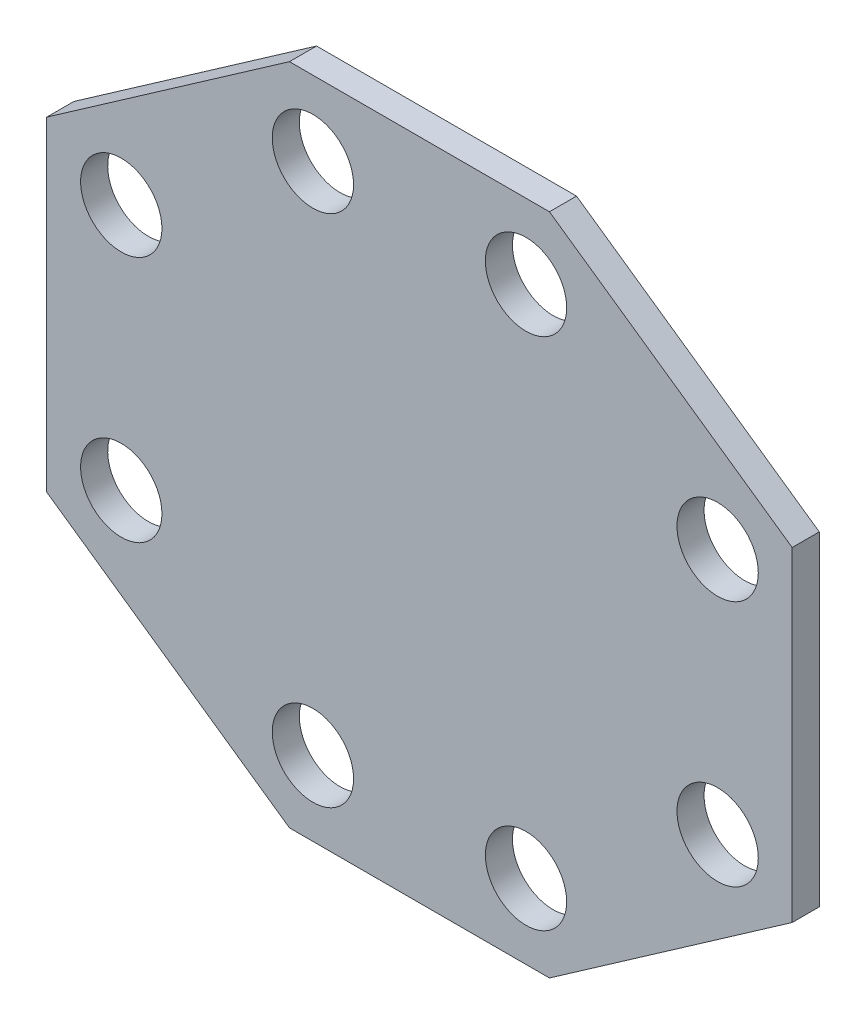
from build123d import *

# Parameters (mm, degrees)
MAIN_PLATE_DEPTH        = 38.1
CUT_EXTRUDE1_DEPTH      = 703.377587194
CUT_EXTRUDE1_DEPTH_BACK = 703.377587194
SKETCH5_R               = 57.15


with BuildPart() as part:
    # Sketch3 → Main Plate (new body)
    with BuildSketch(Plane(origin=(0, 0, 0), x_dir=(0, 1, 0), z_dir=(0, 0, 1))):
        Polygon((228.234235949, 523.855268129), (466.324268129, 182.70492307), (466.324268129, -182.70492307), (228.234235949, -523.855268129), (-228.234235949, -523.855268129), (-466.324268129, -182.70492307), (-466.324268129, 182.70492307), (-228.234235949, 523.855268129), align=None)
    extrude(amount=MAIN_PLATE_DEPTH)

    # Sketch5 → Cut-Extrude1 (cut, two sides: drawn at the far end of the back side and taken through both)
    with BuildSketch(Plane(origin=(0, 0, 0), x_dir=(0, 1, 0), z_dir=(0, 0, 1)).offset(-CUT_EXTRUDE1_DEPTH_BACK)):
        with Locations(Location((-173.588730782, 419.080268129, 0), (0, 0, 270))):
            Circle(SKETCH5_R)
        with Locations(Location((173.588730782, 419.080268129, 0), (0, 0, 270))):
            Circle(SKETCH5_R)
        with Locations(Location((361.549268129, 149.758610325, 0), (0, 0, 270))):
            Circle(SKETCH5_R)
        with Locations(Location((361.549268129, -149.758610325, 0), (0, 0, 270))):
            Circle(SKETCH5_R)
        with Locations(Location((173.588730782, -419.080268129, 0), (0, 0, 270))):
            Circle(SKETCH5_R)
        with Locations(Location((-173.588730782, -419.080268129, 0), (0, 0, 270))):
            Circle(SKETCH5_R)
        with Locations(Location((-361.549268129, -149.758610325, 0), (0, 0, 270))):
            Circle(SKETCH5_R)
        with Locations(Location((-361.549268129, 149.758610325, 0), (0, 0, 270))):
            Circle(SKETCH5_R)
    extrude(amount=CUT_EXTRUDE1_DEPTH + CUT_EXTRUDE1_DEPTH_BACK, mode=Mode.SUBTRACT)


solid = part.part
